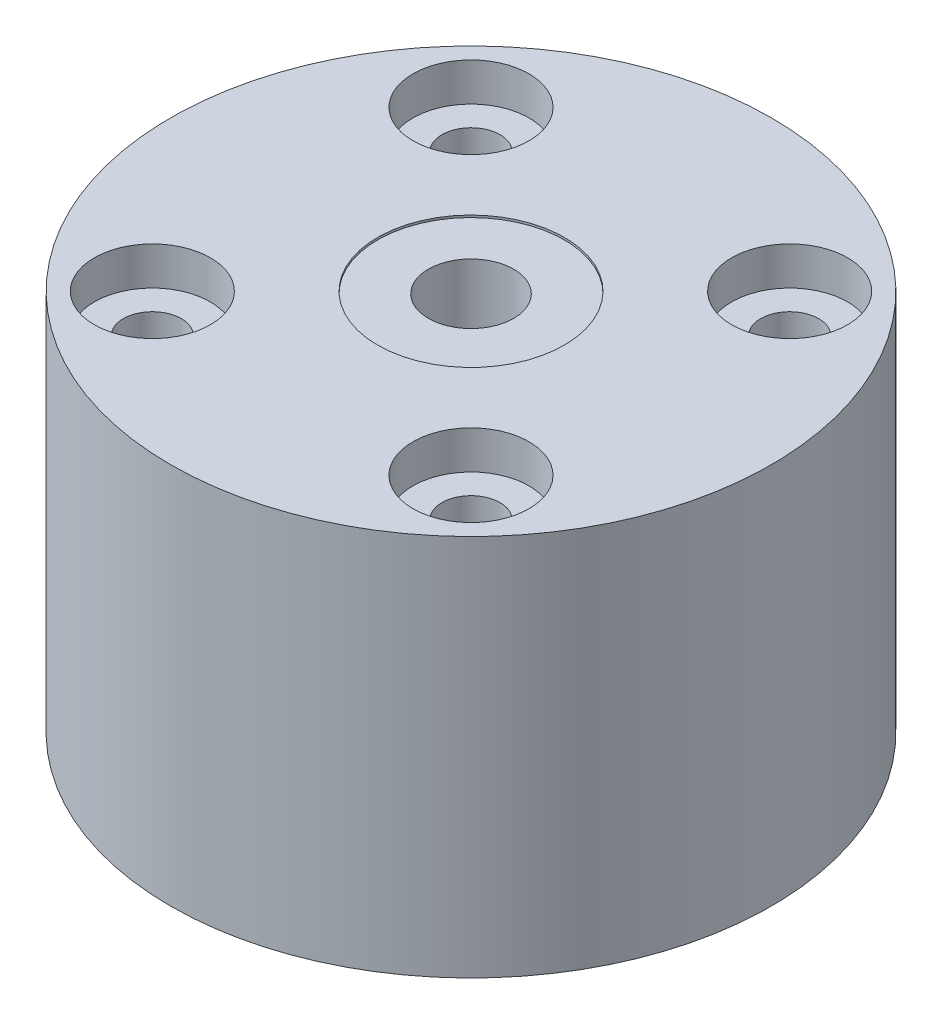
from build123d import *

# Parameters (mm, degrees)
SKETCH1_R                                         = 34.925
BOSS_EXTRUDE1_DEPTH                               = 44.45
SKETCH8_R                                         = 14.845112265
CUT_EXTRUDE1_DEPTH                                = 18.25625
CBORE_FOR_1_4_PAN_HEAD_MACHINE_SCREW1_D           = 6.7564
CBORE_FOR_1_4_PAN_HEAD_MACHINE_SCREW1_CBORE_D     = 13.49248
CBORE_FOR_1_4_PAN_HEAD_MACHINE_SCREW1_CBORE_DEPTH = 4.445
F_7_16_20_TAPPED_HOLE1_D                          = 9.92124
SKETCH9_R                                         = 10.853193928
SPOT_FACE_DEPTH                                   = 0.254


with BuildPart() as part:
    # Sketch1 → Boss-Extrude1 (new body)
    with BuildSketch(Plane(origin=(0, 0, 0), x_dir=(1, 0, 0), z_dir=(0, 1, 0))):
        with Locations(Location((0, 0, 0), (0, 0, 270))):
            Circle(SKETCH1_R)
    extrude(amount=-BOSS_EXTRUDE1_DEPTH)

    # Sketch8 → Cut-Extrude1 (cut)
    with BuildSketch(Plane.XZ.offset(44.45)):
        with Locations(Location((0, 0, 0), (0, 0, 270))):
            Circle(SKETCH8_R)
    extrude(amount=-CUT_EXTRUDE1_DEPTH, mode=Mode.SUBTRACT)

    # CBORE for 1_4 Pan Head Machine Screw1 (through all)
    with Locations(Plane(origin=(-17.142159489, 0, 2.004423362), x_dir=(1, 0, 0), z_dir=(0, 1, 0))):
        with Locations((35.663937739, -16.517354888), (35.663937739, 20.526201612), (-1.379618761, 20.526201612), (-1.379618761, -16.517354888)):
            CounterBoreHole(CBORE_FOR_1_4_PAN_HEAD_MACHINE_SCREW1_D / 2, CBORE_FOR_1_4_PAN_HEAD_MACHINE_SCREW1_CBORE_D / 2, CBORE_FOR_1_4_PAN_HEAD_MACHINE_SCREW1_CBORE_DEPTH)

    # 7_16-20 Tapped Hole1 (through all)
    with Locations(Plane(origin=(0, 0, 0), x_dir=(-1, 0, 0), z_dir=(0, 1, 0))):
        with Locations((0, 0)):
            Hole(F_7_16_20_TAPPED_HOLE1_D / 2)

    # Sketch9 → Spot Face (cut)
    with BuildSketch(Plane(origin=(0, 0, 0), x_dir=(1, 0, 0), z_dir=(0, 1, 0))):
        with Locations(Location((0, 0, 0), (0, 0, 270))):
            Circle(SKETCH9_R)
    extrude(amount=-SPOT_FACE_DEPTH, mode=Mode.SUBTRACT)


solid = part.part
